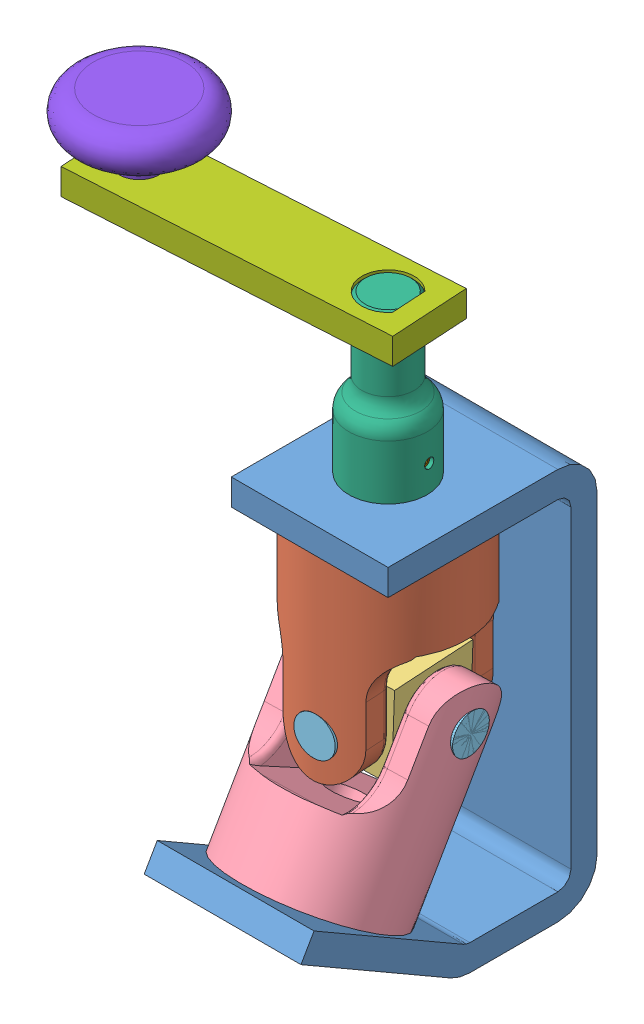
SolidWorks assembly Changes_&.SLDASM, configuration Default (file format 15000). Lengths in mm.
Overall size (101.07 150.22 71.97).
12 component instances, 9 part files, 17 mates.
Components (placement in the parent):
- bracket_&-1: bracket_&.sldprt [Default] at origin size (38.1 95.25 71.97)
- Yoke_male_&-1: Yoke_male_&.sldprt [Default] at (0 34.925 25.4) x (0.998213 0 -0.059764) z (0.059764 0 0.998213) size (38.1 66.67 38.1)
- spider_&-1: spider_&.sldprt [Default] at (0 44.45 25.4) x (0.059764 0 0.998213) z (0.997619 -0.034484 -0.059728) size (20.32 20.32 20.32)
- Yoke_female_&-1: Yoke_female_&.sldprt [Default] at (0 52.6989 20.6375) x (-0.068968 -0.498809 -0.863963) z (-0.997619 0.034484 0.059728) size (38.1 47.62 38.1)
- pin_&-1: pin_&.SLDPRT [Long] at (-1.1385 44.45 6.3841) x (0.994867 0.081798 -0.059563) z (0.059764 0 0.998213) size (9.53 9.53 38.1)
- pin_&-2: pin_&.SLDPRT [Long] at (-19.0046 45.1069 26.5378) x (-0.068955 -0.482156 -0.873368) z (0.997619 -0.034484 -0.059728) size (9.53 9.53 38.1)
- pin_&-3: pin_&.SLDPRT [Long] at (-19.0046 45.1069 26.5378) x (-0.067494 -0.666229 -0.742686) z (0.997619 -0.034484 -0.059728) size (9.53 9.53 38.1)
- crank-assy_&-1: crank-assy_&.sldasm [Default] at (0 89.9 25.4) x (0.998213 0 -0.059764) z (0.059764 0 0.998213) size (89.08 53.98 44.81)
  - crank-shaft_&-1: crank-shaft_&.sldprt [Default] at origin size (19.05 38.1 19.05)
  - crank-arm_&-1: crank-arm_&.sldprt [Default] at (-66.675 31.75 -9.525) size (76.2 6.35 19.05)
  - crank-knob_&-1: crank-knob_&.sldprt [Default] at (-57.15 31.75 0) x (0.661436 0 -0.750001) z (0.750001 0 0.661436) size (31.75 22.23 31.75)
- Set Screw_&-1: Set Screw_&.SLDPRT [Default] at (4.754 96.25 25.1154) x (-0.059337 -0.119248 -0.99109) z (0.998213 0 -0.059764) size (2.29 2.29 3.81)
Mates (geometry in assembly coordinates):
- Concentric1: concentric anti-aligned: cylinder of bracket_&-1 through (0 -6.351 25.4) axis (0 1 0) radius 6.35; cylinder of Yoke_male_&-1 through (0 101.6 25.4) axis (0 -1 0) radius 6.35
- Coincident1: coincident anti-aligned: plane of bracket_&-1 through (19.05 82.55 3.175) normal (0 -1 0); plane of Yoke_male_&-1 through (0 82.55 25.4) normal (0 1 0)
- Concentric2: concentric aligned: cylinder of Yoke_male_&-1 through (-1.1385 44.45 6.3841) axis (0.059764 0 0.998213) radius 4.7625; cylinder of spider_&-1 through (-0.6072 44.45 15.2582) axis (0.059764 0 0.998213) radius 4.7625
- Coincident2: coincident anti-aligned: plane of Yoke_male_&-1 through (-18.4088 27.4697 36.6803) normal (-0.059764 0 -0.998213); plane of spider_&-1 through (10.3933 33.9457 34.9559) normal (0.059764 0 0.998213)
- Concentric3: concentric aligned: cylinder of spider_&-1 through (10.1358 44.0996 24.7932) axis (-0.997619 0.034484 0.059728) radius 4.7625; cylinder of Yoke_female_&-1 through (19.0046 43.7931 24.2622) axis (-0.997619 0.034484 0.059728) radius 4.7625
- Coincident3: coincident anti-aligned: plane of spider_&-1 through (9.1789 33.9457 14.6723) normal (0.997619 -0.034484 -0.059728); plane of Yoke_female_&-1 through (3.9363 -17.7301 -43.0586) normal (-0.997619 0.034484 0.059728)
- Parallel1: parallel anti-aligned: plane of bracket_&-1 through (19.05 21.3868 62.443) normal (0 0.866025 -0.5); plane of Yoke_female_&-1 through (0 11.4544 44.45) normal (0 -0.866025 0.5)
- Concentric4: concentric anti-aligned: cylinder of Yoke_male_&-1 through (-1.1385 44.45 6.3841) axis (0.059764 0 0.998213) radius 4.7625; cylinder of pin_&-1 through (1.1385 44.45 44.4159) axis (-0.059764 0 -0.998213) radius 4.7625
- Tangent1: tangent aligned: cylinder of Yoke_male_&-1 through (0 82.55 25.4) axis (0 -1 0) radius 19.05; plane of pin_&-1 through (-1.1385 44.45 6.3841) normal (-0.059764 0 -0.998213)
- Concentric5: concentric aligned: cylinder of Yoke_female_&-1 through (19.0046 43.7931 24.2622) axis (-0.997619 0.034484 0.059728) radius 4.7625; cylinder of pin_&-2 through (19.0046 43.7931 24.2622) axis (-0.997619 0.034484 0.059728) radius 4.7625
- Tangent2: tangent aligned: cylinder of Yoke_female_&-1 through (0 11.4544 44.45) axis (0 0.866025 -0.5) radius 19.05; plane of pin_&-2 through (19.0046 43.7931 24.2622) normal (0.997619 -0.034484 -0.059728)
- Concentric6: concentric aligned: cylinder of Yoke_female_&-1 through (19.0046 43.7931 24.2622) axis (-0.997619 0.034484 0.059728) radius 4.7625; cylinder of pin_&-3 through (19.0046 43.7931 24.2622) axis (-0.997619 0.034484 0.059728) radius 4.7625
- Tangent3: tangent aligned: cylinder of Yoke_female_&-1 through (0 11.4544 44.45) axis (0 0.866025 -0.5) radius 19.05; plane of pin_&-3 through (-19.0046 45.1069 26.5378) normal (-0.997619 0.034484 0.059728)
- Concentric7: concentric aligned: cylinder of Yoke_male_&-1 through (0 101.6 25.4) axis (0 -1 0) radius 6.35; cylinder of crank-assy_&-1/crank-shaft_&-1 through (0 102.6 25.4) axis (0 -1 0) radius 6.35
- Distance1: distance = 1 mm anti-aligned: plane of bracket_&-1 through (19.05 88.9 3.175) normal (0 1 0); plane of crank-assy_&-1/crank-shaft_&-1 through (0 89.9 25.4) normal (0 -1 0)
- Concentric8: concentric aligned: cylinder of crank-assy_&-1/crank-shaft_&-1 through (9.508 96.25 24.8308) axis (-0.998213 0 0.059764) radius 1.1906; cylinder of Set Screw_&-1 through (8.5572 96.25 24.8877) axis (-0.998213 0 0.059764) radius 1.143
- Coincident4: coincident anti-aligned: plane of Yoke_male_&-1 through (5.005 88.9 29.308) normal (0.998213 0 -0.059764); plane of Set Screw_&-1 through (4.754 96.25 25.1154) normal (-0.998213 0 0.059764)
